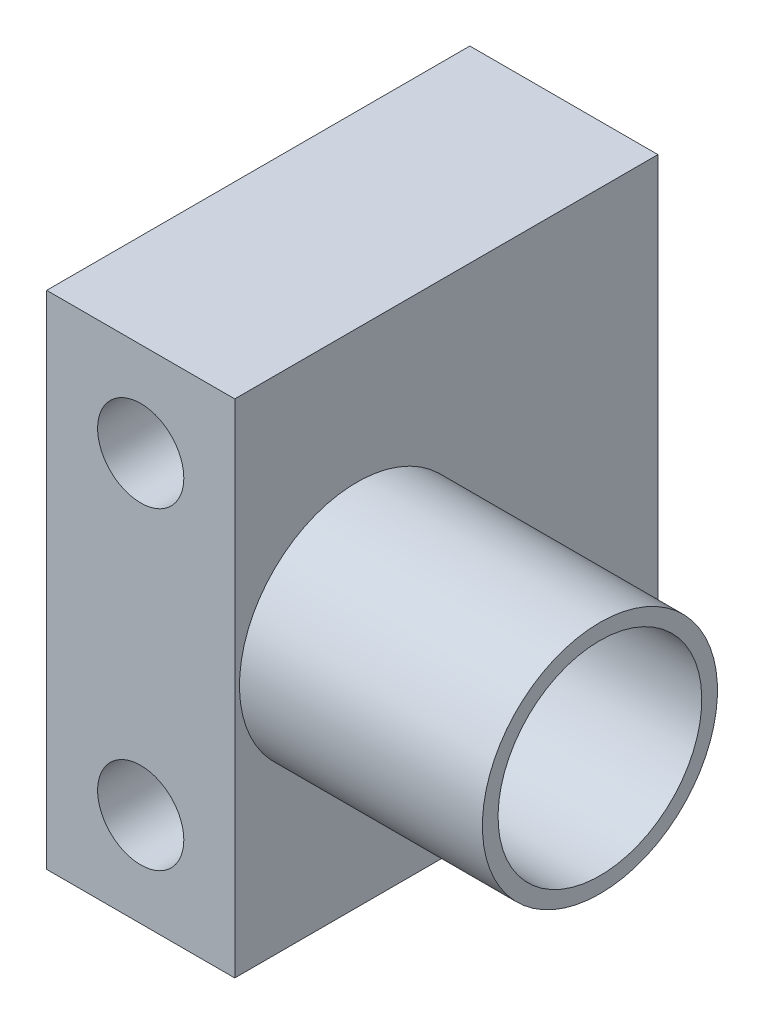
ISO-10303-21;
HEADER;
FILE_DESCRIPTION(('STEP AP214'),'2;1');
FILE_NAME('part.step','',(''),(''),'','','');
FILE_SCHEMA(('AUTOMOTIVE_DESIGN { 1 0 10303 214 1 1 1 1 }'));
ENDSEC;
DATA;
#1=APPLICATION_CONTEXT('core data for automotive mechanical design processes');
#2=APPLICATION_PROTOCOL_DEFINITION('international standard','automotive_design',2000,#1);
#3=PRODUCT_CONTEXT('',#1,'mechanical');
#4=PRODUCT('Part','Part','',(#3));
#5=PRODUCT_RELATED_PRODUCT_CATEGORY('part','',(#4));
#6=PRODUCT_DEFINITION_FORMATION('','',#4);
#7=PRODUCT_DEFINITION_CONTEXT('part definition',#1,'design');
#8=PRODUCT_DEFINITION('design','',#6,#7);
#9=PRODUCT_DEFINITION_SHAPE('','',#8);
#10=(LENGTH_UNIT() NAMED_UNIT(*) SI_UNIT(.MILLI.,.METRE.));
#11=(NAMED_UNIT(*) PLANE_ANGLE_UNIT() SI_UNIT($,.RADIAN.));
#12=(NAMED_UNIT(*) SI_UNIT($,.STERADIAN.) SOLID_ANGLE_UNIT());
#13=UNCERTAINTY_MEASURE_WITH_UNIT(LENGTH_MEASURE(1.E-05),#10,'distance_accuracy_value','');
#14=(GEOMETRIC_REPRESENTATION_CONTEXT(3) GLOBAL_UNCERTAINTY_ASSIGNED_CONTEXT((#13)) GLOBAL_UNIT_ASSIGNED_CONTEXT((#10,
#11,#12)) REPRESENTATION_CONTEXT('',''));
#15=CARTESIAN_POINT('',(0.,0.,0.));
#16=DIRECTION('',(0.,0.,1.));
#17=DIRECTION('',(1.,0.,0.));
#18=AXIS2_PLACEMENT_3D('',#15,#16,#17);
#19=CARTESIAN_POINT('',(6.,26.,27.));
#20=DIRECTION('',(-1.,0.,0.));
#21=DIRECTION('',(0.,-1.,0.));
#22=AXIS2_PLACEMENT_3D('',#19,#20,#21);
#23=PLANE('',#22);
#24=DIRECTION('',(0.,1.,0.));
#25=VECTOR('',#24,1.);
#26=CARTESIAN_POINT('',(6.,26.,0.));
#27=LINE('',#26,#25);
#28=CARTESIAN_POINT('',(6.,-6.,0.));
#29=VERTEX_POINT('',#28);
#30=CARTESIAN_POINT('',(6.,26.,0.));
#31=VERTEX_POINT('',#30);
#32=EDGE_CURVE('E62',#29,#31,#27,.T.);
#33=ORIENTED_EDGE('',*,*,#32,.T.);
#34=DIRECTION('',(0.,0.,-1.));
#35=VECTOR('',#34,1.);
#36=CARTESIAN_POINT('',(6.,26.,27.));
#37=LINE('',#36,#35);
#38=CARTESIAN_POINT('',(6.,26.,27.));
#39=VERTEX_POINT('',#38);
#40=EDGE_CURVE('E23',#39,#31,#37,.T.);
#41=ORIENTED_EDGE('',*,*,#40,.F.);
#42=DIRECTION('',(0.,1.,0.));
#43=VECTOR('',#42,1.);
#44=CARTESIAN_POINT('',(6.,26.,27.));
#45=LINE('',#44,#43);
#46=CARTESIAN_POINT('',(6.,-6.,27.));
#47=VERTEX_POINT('',#46);
#48=EDGE_CURVE('E88',#47,#39,#45,.T.);
#49=ORIENTED_EDGE('',*,*,#48,.F.);
#50=DIRECTION('',(0.,0.,-1.));
#51=VECTOR('',#50,1.);
#52=CARTESIAN_POINT('',(6.,-6.,27.));
#53=LINE('',#52,#51);
#54=EDGE_CURVE('E77',#47,#29,#53,.T.);
#55=ORIENTED_EDGE('',*,*,#54,.T.);
#56=EDGE_LOOP('',(#33,#41,#49,#55));
#57=FACE_BOUND('',#56,.T.);
#58=CARTESIAN_POINT('',(6.,10.,19.2));
#59=DIRECTION('',(-1.,0.,0.));
#60=DIRECTION('',(0.,-1.,0.));
#61=AXIS2_PLACEMENT_3D('',#58,#59,#60);
#62=CIRCLE('',#61,7.5);
#63=CARTESIAN_POINT('',(6.,2.5,19.2));
#64=VERTEX_POINT('',#63);
#65=EDGE_CURVE('E10',#64,#64,#62,.F.);
#66=ORIENTED_EDGE('',*,*,#65,.F.);
#67=EDGE_LOOP('',(#66));
#68=FACE_BOUND('',#67,.T.);
#69=ADVANCED_FACE('F15',(#57,#68),#23,.F.);
#70=CARTESIAN_POINT('',(6.,26.,27.));
#71=DIRECTION('',(0.,0.,-1.));
#72=DIRECTION('',(-1.,0.,0.));
#73=AXIS2_PLACEMENT_3D('',#70,#71,#72);
#74=PLANE('',#73);
#75=CARTESIAN_POINT('',(0.,20.,27.));
#76=DIRECTION('',(0.,0.,1.));
#77=DIRECTION('',(1.,0.,0.));
#78=AXIS2_PLACEMENT_3D('',#75,#76,#77);
#79=CIRCLE('',#78,2.75);
#80=CARTESIAN_POINT('',(2.75,20.,27.));
#81=VERTEX_POINT('',#80);
#82=EDGE_CURVE('E78',#81,#81,#79,.T.);
#83=ORIENTED_EDGE('',*,*,#82,.F.);
#84=EDGE_LOOP('',(#83));
#85=FACE_BOUND('',#84,.T.);
#86=ORIENTED_EDGE('',*,*,#48,.T.);
#87=DIRECTION('',(-1.,0.,0.));
#88=VECTOR('',#87,1.);
#89=CARTESIAN_POINT('',(6.,26.,27.));
#90=LINE('',#89,#88);
#91=CARTESIAN_POINT('',(-6.,26.,27.));
#92=VERTEX_POINT('',#91);
#93=EDGE_CURVE('E70',#39,#92,#90,.T.);
#94=ORIENTED_EDGE('',*,*,#93,.T.);
#95=DIRECTION('',(0.,-1.,0.));
#96=VECTOR('',#95,1.);
#97=CARTESIAN_POINT('',(-6.,26.,27.));
#98=LINE('',#97,#96);
#99=CARTESIAN_POINT('',(-6.,-6.,27.));
#100=VERTEX_POINT('',#99);
#101=EDGE_CURVE('E35',#92,#100,#98,.T.);
#102=ORIENTED_EDGE('',*,*,#101,.T.);
#103=DIRECTION('',(1.,0.,0.));
#104=VECTOR('',#103,1.);
#105=CARTESIAN_POINT('',(6.,-6.,27.));
#106=LINE('',#105,#104);
#107=EDGE_CURVE('E30',#100,#47,#106,.T.);
#108=ORIENTED_EDGE('',*,*,#107,.T.);
#109=EDGE_LOOP('',(#86,#94,#102,#108));
#110=FACE_BOUND('',#109,.T.);
#111=CARTESIAN_POINT('',(0.,0.,27.));
#112=DIRECTION('',(0.,0.,1.));
#113=DIRECTION('',(1.,0.,0.));
#114=AXIS2_PLACEMENT_3D('',#111,#112,#113);
#115=CIRCLE('',#114,2.75);
#116=CARTESIAN_POINT('',(2.75,0.,27.));
#117=VERTEX_POINT('',#116);
#118=EDGE_CURVE('E108',#117,#117,#115,.T.);
#119=ORIENTED_EDGE('',*,*,#118,.F.);
#120=EDGE_LOOP('',(#119));
#121=FACE_BOUND('',#120,.T.);
#122=ADVANCED_FACE('F101',(#85,#110,#121),#74,.F.);
#123=CARTESIAN_POINT('',(6.,26.,0.));
#124=DIRECTION('',(0.,0.,-1.));
#125=DIRECTION('',(-1.,0.,0.));
#126=AXIS2_PLACEMENT_3D('',#123,#124,#125);
#127=PLANE('',#126);
#128=CARTESIAN_POINT('',(0.,20.,0.));
#129=DIRECTION('',(0.,0.,1.));
#130=DIRECTION('',(1.,0.,0.));
#131=AXIS2_PLACEMENT_3D('',#128,#129,#130);
#132=CIRCLE('',#131,2.75);
#133=CARTESIAN_POINT('',(2.75,20.,0.));
#134=VERTEX_POINT('',#133);
#135=EDGE_CURVE('E81',#134,#134,#132,.T.);
#136=ORIENTED_EDGE('',*,*,#135,.T.);
#137=EDGE_LOOP('',(#136));
#138=FACE_BOUND('',#137,.T.);
#139=ORIENTED_EDGE('',*,*,#32,.F.);
#140=DIRECTION('',(1.,0.,0.));
#141=VECTOR('',#140,1.);
#142=CARTESIAN_POINT('',(6.,-6.,0.));
#143=LINE('',#142,#141);
#144=CARTESIAN_POINT('',(-6.,-6.,0.));
#145=VERTEX_POINT('',#144);
#146=EDGE_CURVE('E86',#145,#29,#143,.T.);
#147=ORIENTED_EDGE('',*,*,#146,.F.);
#148=DIRECTION('',(0.,-1.,0.));
#149=VECTOR('',#148,1.);
#150=CARTESIAN_POINT('',(-6.,26.,0.));
#151=LINE('',#150,#149);
#152=CARTESIAN_POINT('',(-6.,26.,0.));
#153=VERTEX_POINT('',#152);
#154=EDGE_CURVE('E63',#153,#145,#151,.T.);
#155=ORIENTED_EDGE('',*,*,#154,.F.);
#156=DIRECTION('',(-1.,0.,0.));
#157=VECTOR('',#156,1.);
#158=CARTESIAN_POINT('',(6.,26.,0.));
#159=LINE('',#158,#157);
#160=EDGE_CURVE('E56',#31,#153,#159,.T.);
#161=ORIENTED_EDGE('',*,*,#160,.F.);
#162=EDGE_LOOP('',(#139,#147,#155,#161));
#163=FACE_BOUND('',#162,.T.);
#164=CARTESIAN_POINT('',(0.,0.,0.));
#165=DIRECTION('',(0.,0.,1.));
#166=DIRECTION('',(1.,0.,0.));
#167=AXIS2_PLACEMENT_3D('',#164,#165,#166);
#168=CIRCLE('',#167,2.75);
#169=CARTESIAN_POINT('',(2.75,0.,0.));
#170=VERTEX_POINT('',#169);
#171=EDGE_CURVE('E110',#170,#170,#168,.T.);
#172=ORIENTED_EDGE('',*,*,#171,.T.);
#173=EDGE_LOOP('',(#172));
#174=FACE_BOUND('',#173,.T.);
#175=ADVANCED_FACE('F58',(#138,#163,#174),#127,.T.);
#176=CARTESIAN_POINT('',(6.,26.,27.));
#177=DIRECTION('',(0.,-1.,0.));
#178=DIRECTION('',(1.,0.,0.));
#179=AXIS2_PLACEMENT_3D('',#176,#177,#178);
#180=PLANE('',#179);
#181=ORIENTED_EDGE('',*,*,#160,.T.);
#182=DIRECTION('',(0.,0.,-1.));
#183=VECTOR('',#182,1.);
#184=CARTESIAN_POINT('',(-6.,26.,27.));
#185=LINE('',#184,#183);
#186=EDGE_CURVE('E73',#92,#153,#185,.T.);
#187=ORIENTED_EDGE('',*,*,#186,.F.);
#188=ORIENTED_EDGE('',*,*,#93,.F.);
#189=ORIENTED_EDGE('',*,*,#40,.T.);
#190=EDGE_LOOP('',(#181,#187,#188,#189));
#191=FACE_BOUND('',#190,.T.);
#192=ADVANCED_FACE('F69',(#191),#180,.F.);
#193=CARTESIAN_POINT('',(-6.,26.,27.));
#194=DIRECTION('',(1.,0.,0.));
#195=DIRECTION('',(0.,1.,0.));
#196=AXIS2_PLACEMENT_3D('',#193,#194,#195);
#197=PLANE('',#196);
#198=CARTESIAN_POINT('',(-6.,10.,19.2));
#199=DIRECTION('',(-1.,0.,0.));
#200=DIRECTION('',(0.,-1.,0.));
#201=AXIS2_PLACEMENT_3D('',#198,#199,#200);
#202=CIRCLE('',#201,4.25);
#203=CARTESIAN_POINT('',(-6.,5.75,19.2));
#204=VERTEX_POINT('',#203);
#205=EDGE_CURVE('E119',#204,#204,#202,.T.);
#206=ORIENTED_EDGE('',*,*,#205,.F.);
#207=EDGE_LOOP('',(#206));
#208=FACE_BOUND('',#207,.T.);
#209=ORIENTED_EDGE('',*,*,#154,.T.);
#210=DIRECTION('',(0.,0.,-1.));
#211=VECTOR('',#210,1.);
#212=CARTESIAN_POINT('',(-6.,-6.,27.));
#213=LINE('',#212,#211);
#214=EDGE_CURVE('E94',#100,#145,#213,.T.);
#215=ORIENTED_EDGE('',*,*,#214,.F.);
#216=ORIENTED_EDGE('',*,*,#101,.F.);
#217=ORIENTED_EDGE('',*,*,#186,.T.);
#218=EDGE_LOOP('',(#209,#215,#216,#217));
#219=FACE_BOUND('',#218,.T.);
#220=ADVANCED_FACE('F98',(#208,#219),#197,.F.);
#221=CARTESIAN_POINT('',(6.,-6.,27.));
#222=DIRECTION('',(0.,1.,0.));
#223=DIRECTION('',(-1.,0.,0.));
#224=AXIS2_PLACEMENT_3D('',#221,#222,#223);
#225=PLANE('',#224);
#226=ORIENTED_EDGE('',*,*,#146,.T.);
#227=ORIENTED_EDGE('',*,*,#54,.F.);
#228=ORIENTED_EDGE('',*,*,#107,.F.);
#229=ORIENTED_EDGE('',*,*,#214,.T.);
#230=EDGE_LOOP('',(#226,#227,#228,#229));
#231=FACE_BOUND('',#230,.T.);
#232=ADVANCED_FACE('F100',(#231),#225,.F.);
#233=CARTESIAN_POINT('',(0.,20.,27.));
#234=DIRECTION('',(0.,0.,-1.));
#235=DIRECTION('',(-1.,0.,0.));
#236=AXIS2_PLACEMENT_3D('',#233,#234,#235);
#237=CYLINDRICAL_SURFACE('',#236,2.75);
#238=ORIENTED_EDGE('',*,*,#82,.T.);
#239=EDGE_LOOP('',(#238));
#240=FACE_BOUND('',#239,.T.);
#241=ORIENTED_EDGE('',*,*,#135,.F.);
#242=EDGE_LOOP('',(#241));
#243=FACE_BOUND('',#242,.T.);
#244=ADVANCED_FACE('F189',(#240,#243),#237,.F.);
#245=CARTESIAN_POINT('',(0.,0.,27.));
#246=DIRECTION('',(0.,0.,-1.));
#247=DIRECTION('',(-1.,0.,0.));
#248=AXIS2_PLACEMENT_3D('',#245,#246,#247);
#249=CYLINDRICAL_SURFACE('',#248,2.75);
#250=ORIENTED_EDGE('',*,*,#118,.T.);
#251=EDGE_LOOP('',(#250));
#252=FACE_BOUND('',#251,.T.);
#253=ORIENTED_EDGE('',*,*,#171,.F.);
#254=EDGE_LOOP('',(#253));
#255=FACE_BOUND('',#254,.T.);
#256=ADVANCED_FACE('F142',(#252,#255),#249,.F.);
#257=CARTESIAN_POINT('',(21.5,10.,19.2));
#258=DIRECTION('',(-1.,0.,0.));
#259=DIRECTION('',(0.,-1.,0.));
#260=AXIS2_PLACEMENT_3D('',#257,#258,#259);
#261=CYLINDRICAL_SURFACE('',#260,7.5);
#262=CARTESIAN_POINT('',(21.5,10.,19.2));
#263=DIRECTION('',(1.,0.,0.));
#264=DIRECTION('',(0.,1.,0.));
#265=AXIS2_PLACEMENT_3D('',#262,#263,#264);
#266=CIRCLE('',#265,7.5);
#267=CARTESIAN_POINT('',(21.5,17.5,19.2));
#268=VERTEX_POINT('',#267);
#269=EDGE_CURVE('E114',#268,#268,#266,.T.);
#270=ORIENTED_EDGE('',*,*,#269,.F.);
#271=EDGE_LOOP('',(#270));
#272=FACE_BOUND('',#271,.T.);
#273=ORIENTED_EDGE('',*,*,#65,.T.);
#274=EDGE_LOOP('',(#273));
#275=FACE_BOUND('',#274,.T.);
#276=ADVANCED_FACE('F136',(#272,#275),#261,.T.);
#277=CARTESIAN_POINT('',(21.5,10.,19.2));
#278=DIRECTION('',(1.,0.,0.));
#279=DIRECTION('',(0.,1.,0.));
#280=AXIS2_PLACEMENT_3D('',#277,#278,#279);
#281=PLANE('',#280);
#282=CARTESIAN_POINT('',(21.5,10.,19.2));
#283=DIRECTION('',(1.,0.,0.));
#284=DIRECTION('',(0.,1.,0.));
#285=AXIS2_PLACEMENT_3D('',#282,#283,#284);
#286=CIRCLE('',#285,6.5);
#287=CARTESIAN_POINT('',(21.5,16.5,19.2));
#288=VERTEX_POINT('',#287);
#289=EDGE_CURVE('E125',#288,#288,#286,.T.);
#290=ORIENTED_EDGE('',*,*,#289,.F.);
#291=EDGE_LOOP('',(#290));
#292=FACE_BOUND('',#291,.T.);
#293=ORIENTED_EDGE('',*,*,#269,.T.);
#294=EDGE_LOOP('',(#293));
#295=FACE_BOUND('',#294,.T.);
#296=ADVANCED_FACE('F132',(#292,#295),#281,.T.);
#297=CARTESIAN_POINT('',(21.5,10.,19.2));
#298=DIRECTION('',(-1.,0.,0.));
#299=DIRECTION('',(0.,-1.,0.));
#300=AXIS2_PLACEMENT_3D('',#297,#298,#299);
#301=CYLINDRICAL_SURFACE('',#300,4.25);
#302=CARTESIAN_POINT('',(7.,10.,19.2));
#303=DIRECTION('',(-1.,0.,0.));
#304=DIRECTION('',(0.,-1.,0.));
#305=AXIS2_PLACEMENT_3D('',#302,#303,#304);
#306=CIRCLE('',#305,4.25);
#307=CARTESIAN_POINT('',(7.,5.75,19.2));
#308=VERTEX_POINT('',#307);
#309=EDGE_CURVE('E18',#308,#308,#306,.F.);
#310=ORIENTED_EDGE('',*,*,#309,.T.);
#311=EDGE_LOOP('',(#310));
#312=FACE_BOUND('',#311,.T.);
#313=ORIENTED_EDGE('',*,*,#205,.T.);
#314=EDGE_LOOP('',(#313));
#315=FACE_BOUND('',#314,.T.);
#316=ADVANCED_FACE('F135',(#312,#315),#301,.F.);
#317=CARTESIAN_POINT('',(7.,26.,27.));
#318=DIRECTION('',(-1.,0.,0.));
#319=DIRECTION('',(0.,-1.,0.));
#320=AXIS2_PLACEMENT_3D('',#317,#318,#319);
#321=PLANE('',#320);
#322=CARTESIAN_POINT('',(7.,10.,19.2));
#323=DIRECTION('',(-1.,0.,0.));
#324=DIRECTION('',(0.,-1.,0.));
#325=AXIS2_PLACEMENT_3D('',#322,#323,#324);
#326=CIRCLE('',#325,6.5);
#327=CARTESIAN_POINT('',(7.,3.5,19.2));
#328=VERTEX_POINT('',#327);
#329=EDGE_CURVE('E122',#328,#328,#326,.F.);
#330=ORIENTED_EDGE('',*,*,#329,.T.);
#331=EDGE_LOOP('',(#330));
#332=FACE_BOUND('',#331,.T.);
#333=ORIENTED_EDGE('',*,*,#309,.F.);
#334=EDGE_LOOP('',(#333));
#335=FACE_BOUND('',#334,.T.);
#336=ADVANCED_FACE('F220',(#332,#335),#321,.F.);
#337=CARTESIAN_POINT('',(-12.3847763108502,10.,19.2));
#338=DIRECTION('',(1.,0.,0.));
#339=DIRECTION('',(0.,1.,0.));
#340=AXIS2_PLACEMENT_3D('',#337,#338,#339);
#341=CYLINDRICAL_SURFACE('',#340,6.5);
#342=ORIENTED_EDGE('',*,*,#289,.T.);
#343=EDGE_LOOP('',(#342));
#344=FACE_BOUND('',#343,.T.);
#345=ORIENTED_EDGE('',*,*,#329,.F.);
#346=EDGE_LOOP('',(#345));
#347=FACE_BOUND('',#346,.T.);
#348=ADVANCED_FACE('F129',(#344,#347),#341,.F.);
#349=CLOSED_SHELL('',(#69,#122,#175,#192,#220,#232,#244,#256,#276,#296,#316,#336,#348));
#350=MANIFOLD_SOLID_BREP('B1',#349);
#351=ADVANCED_BREP_SHAPE_REPRESENTATION('',(#18,#350),#14);
#352=SHAPE_DEFINITION_REPRESENTATION(#9,#351);
ENDSEC;
END-ISO-10303-21;
